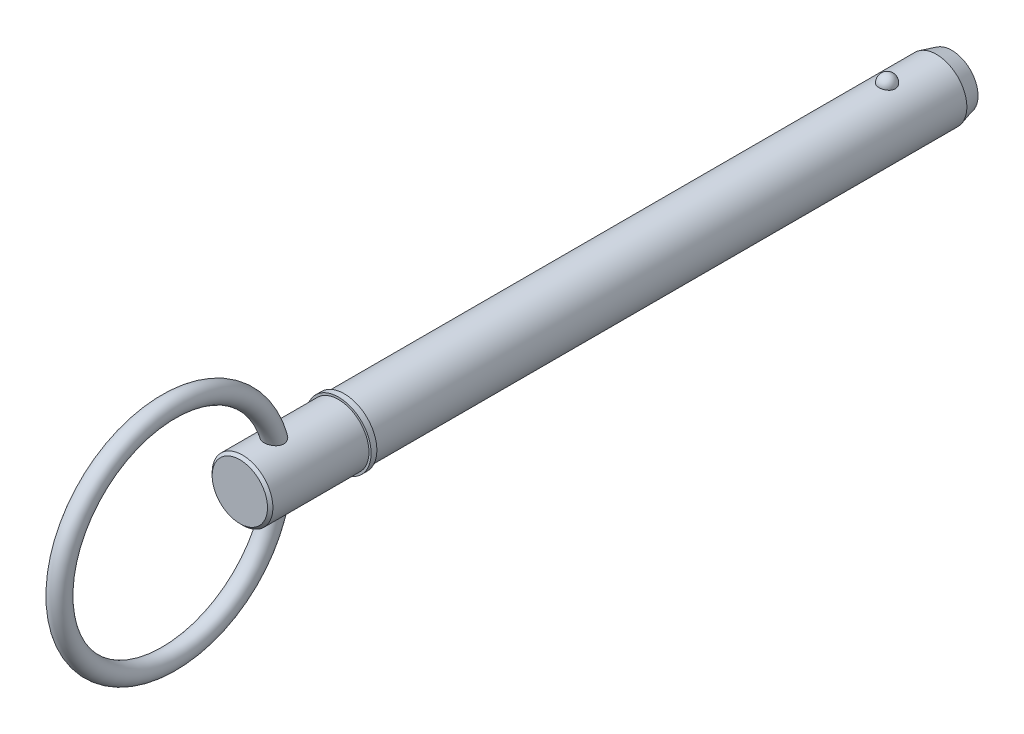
from build123d import *

# Parameters (mm, degrees)
SKETCH2_R           = 7.94
BOSS_EXTRUDE1_DEPTH = 139.7
BOSS_EXTRUDE2_START = 19.05
SKETCH3_R           = 7.94
BOSS_EXTRUDE2_DEPTH = 19.05
CHAMFER1_SIZE       = 4
CHAMFER1_SIZE2      = 1.07179677
SKETCH20_W          = 1.5
SKETCH20_H          = 8.5
SKETCH21_R          = 7.94
BOSS_EXTRUDE3_DEPTH = 27.31
CHAMFER2_SIZE       = 0.7
SKETCH24_R          = 2.5


with BuildPart() as part:
    # Sketch2 → Boss-Extrude1 (new body)
    with BuildSketch(Plane.XY):
        Circle(SKETCH2_R)
    extrude(amount=BOSS_EXTRUDE1_DEPTH)

    # Sketch3 → Boss-Extrude2 (add)
    with BuildSketch(Plane(origin=(0, 0, 0), x_dir=(-1, 0, 0), z_dir=(0, 0, -1)).offset(BOSS_EXTRUDE2_START)):
        Circle(SKETCH3_R)
    extrude(amount=-BOSS_EXTRUDE2_DEPTH)

    # Chamfer1
    chamfer1_edges = [part.edges().sort_by_distance(p)[0] for p in [
        (7.94, 0, -19.05),
    ]]
    chamfer1_side = [part.faces().sort_by_distance(p)[0] for p in [
        (7.94, 0, -9.525),
    ]]
    chamfer(chamfer1_edges, length=CHAMFER1_SIZE, length2=CHAMFER1_SIZE2, reference=chamfer1_side[0])

    # Sketch18 → Revolve1 (revolve)
    with BuildSketch(Plane(origin=(0, 0, 0), x_dir=(0, 0, -1), z_dir=(1, 0, 0))):
        with BuildLine():
            Line((2.15, 10.09), (2.15, 5.79))
            ThreePointArc((2.15, 5.79), (0, 7.94), (2.15, 10.09))
        make_face()
    revolve(axis=Axis((0, 10.09, -2.15), (0, -1, 0)))

    # Sketch20 → Revolve2 (revolve)
    with BuildSketch(Plane(origin=(0, 0, 0), x_dir=(0, 0, -1), z_dir=(1, 0, 0)), mode=Mode.PRIVATE) as revolve2_sk:
        with Locations((-140.45, 4.25)):
            Rectangle(SKETCH20_W, SKETCH20_H)
    revolve(revolve2_sk.sketch.rotate(Axis((0, 0, 33.728787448), (0, 0, 1)), 90), axis=Axis((0, 0, 33.728787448), (0, 0, 1)))

    # Sketch21 → Boss-Extrude3 (add)
    with BuildSketch(Plane(origin=(0, 0, 139.7), x_dir=(-1, 0, 0), z_dir=(0, 0, -1))):
        Circle(SKETCH21_R)
    extrude(amount=-BOSS_EXTRUDE3_DEPTH)

    # Chamfer2
    chamfer2_edges = [part.edges().sort_by_distance(p)[0] for p in [
        (7.94, 0, 167.01),
    ]]
    chamfer(chamfer2_edges, length=CHAMFER2_SIZE)

    # Sweep1: sweep along a path in Sketch23
    with BuildLine(Plane(origin=(0, 0, 0), x_dir=(0, 0, -1), z_dir=(1, 0, 0))) as sweep1_path:
        CenterArc((-185.585, 0), 28.575, 0, 360)
    # Sketch24 → Sweep1 (sweep)
    with BuildSketch(Plane(origin=(0, 0, 0), x_dir=(1, 0, 0), z_dir=(0, 1, 0))):
        with Locations((0, -157.01)):
            Circle(SKETCH24_R)
    sweep(path=sweep1_path.line)


solid = part.part
